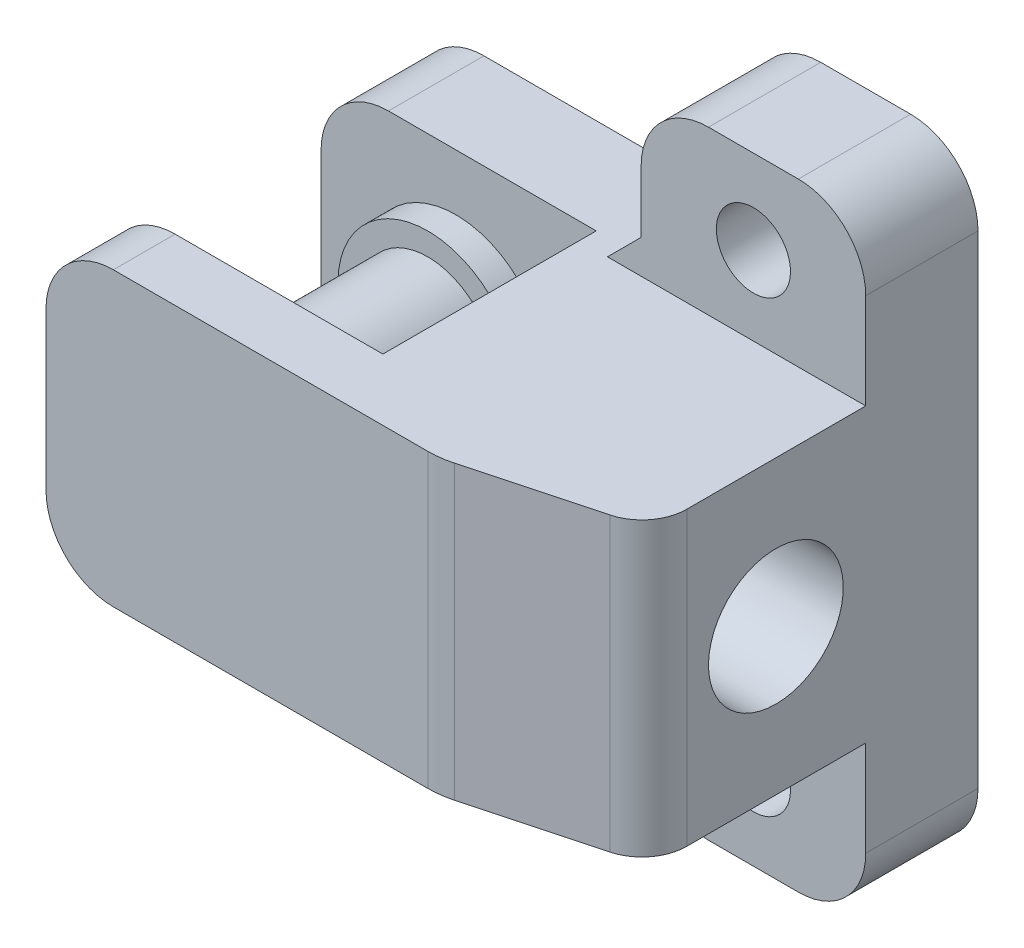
ISO-10303-21;
HEADER;
FILE_DESCRIPTION(('STEP AP214'),'2;1');
FILE_NAME('part.step','',(''),(''),'','','');
FILE_SCHEMA(('AUTOMOTIVE_DESIGN { 1 0 10303 214 1 1 1 1 }'));
ENDSEC;
DATA;
#1=APPLICATION_CONTEXT('core data for automotive mechanical design processes');
#2=APPLICATION_PROTOCOL_DEFINITION('international standard','automotive_design',2000,#1);
#3=PRODUCT_CONTEXT('',#1,'mechanical');
#4=PRODUCT('Part','Part','',(#3));
#5=PRODUCT_RELATED_PRODUCT_CATEGORY('part','',(#4));
#6=PRODUCT_DEFINITION_FORMATION('','',#4);
#7=PRODUCT_DEFINITION_CONTEXT('part definition',#1,'design');
#8=PRODUCT_DEFINITION('design','',#6,#7);
#9=PRODUCT_DEFINITION_SHAPE('','',#8);
#10=(LENGTH_UNIT() NAMED_UNIT(*) SI_UNIT(.MILLI.,.METRE.));
#11=(NAMED_UNIT(*) PLANE_ANGLE_UNIT() SI_UNIT($,.RADIAN.));
#12=(NAMED_UNIT(*) SI_UNIT($,.STERADIAN.) SOLID_ANGLE_UNIT());
#13=UNCERTAINTY_MEASURE_WITH_UNIT(LENGTH_MEASURE(1.E-05),#10,'distance_accuracy_value','');
#14=(GEOMETRIC_REPRESENTATION_CONTEXT(3) GLOBAL_UNCERTAINTY_ASSIGNED_CONTEXT((#13)) GLOBAL_UNIT_ASSIGNED_CONTEXT((#10,
#11,#12)) REPRESENTATION_CONTEXT('',''));
#15=CARTESIAN_POINT('',(0.,0.,0.));
#16=DIRECTION('',(0.,0.,1.));
#17=DIRECTION('',(1.,0.,0.));
#18=AXIS2_PLACEMENT_3D('',#15,#16,#17);
#19=CARTESIAN_POINT('',(-8.1,20.,18.));
#20=DIRECTION('',(-1.,0.,0.));
#21=DIRECTION('',(0.,-1.,0.));
#22=AXIS2_PLACEMENT_3D('',#19,#20,#21);
#23=PLANE('',#22);
#24=CARTESIAN_POINT('',(-8.1,20.,18.));
#25=DIRECTION('',(-1.,0.,0.));
#26=DIRECTION('',(0.,-1.,0.));
#27=AXIS2_PLACEMENT_3D('',#24,#25,#26);
#28=CIRCLE('',#27,6.);
#29=CARTESIAN_POINT('',(-8.1,14.,18.));
#30=VERTEX_POINT('',#29);
#31=EDGE_CURVE('E18',#30,#30,#28,.T.);
#32=ORIENTED_EDGE('',*,*,#31,.F.);
#33=EDGE_LOOP('',(#32));
#34=FACE_BOUND('',#33,.T.);
#35=CARTESIAN_POINT('',(-8.1,20.,18.));
#36=DIRECTION('',(-1.,0.,0.));
#37=DIRECTION('',(0.,-1.,0.));
#38=AXIS2_PLACEMENT_3D('',#35,#36,#37);
#39=CIRCLE('',#38,8.5);
#40=CARTESIAN_POINT('',(-8.1,11.5,18.));
#41=VERTEX_POINT('',#40);
#42=EDGE_CURVE('E338',#41,#41,#39,.F.);
#43=ORIENTED_EDGE('',*,*,#42,.F.);
#44=EDGE_LOOP('',(#43));
#45=FACE_BOUND('',#44,.T.);
#46=ADVANCED_FACE('F14',(#34,#45),#23,.T.);
#47=CARTESIAN_POINT('',(10.,20.,18.));
#48=DIRECTION('',(-1.,0.,0.));
#49=DIRECTION('',(0.,-1.,0.));
#50=AXIS2_PLACEMENT_3D('',#47,#48,#49);
#51=CYLINDRICAL_SURFACE('',#50,6.);
#52=ORIENTED_EDGE('',*,*,#31,.T.);
#53=EDGE_LOOP('',(#52));
#54=FACE_BOUND('',#53,.T.);
#55=CARTESIAN_POINT('',(10.,20.,18.));
#56=DIRECTION('',(-1.,0.,0.));
#57=DIRECTION('',(0.,-1.,0.));
#58=AXIS2_PLACEMENT_3D('',#55,#56,#57);
#59=CIRCLE('',#58,6.);
#60=CARTESIAN_POINT('',(10.,14.,18.));
#61=VERTEX_POINT('',#60);
#62=EDGE_CURVE('E341',#61,#61,#59,.T.);
#63=ORIENTED_EDGE('',*,*,#62,.F.);
#64=EDGE_LOOP('',(#63));
#65=FACE_BOUND('',#64,.T.);
#66=ADVANCED_FACE('F596',(#54,#65),#51,.F.);
#67=CARTESIAN_POINT('',(-10.,36.,10.));
#68=DIRECTION('',(-1.,0.,0.));
#69=DIRECTION('',(0.,-1.,0.));
#70=AXIS2_PLACEMENT_3D('',#67,#68,#69);
#71=PLANE('',#70);
#72=DIRECTION('',(0.,1.,0.));
#73=VECTOR('',#72,1.);
#74=CARTESIAN_POINT('',(-10.,7.,0.));
#75=LINE('',#74,#73);
#76=CARTESIAN_POINT('',(-10.,36.,0.));
#77=VERTEX_POINT('',#76);
#78=CARTESIAN_POINT('',(-10.,41.5,0.));
#79=VERTEX_POINT('',#78);
#80=EDGE_CURVE('E368',#77,#79,#75,.T.);
#81=ORIENTED_EDGE('',*,*,#80,.F.);
#82=DIRECTION('',(0.,0.,1.));
#83=VECTOR('',#82,1.);
#84=CARTESIAN_POINT('',(-10.,36.,10.));
#85=LINE('',#84,#83);
#86=CARTESIAN_POINT('',(-10.,36.,10.));
#87=VERTEX_POINT('',#86);
#88=EDGE_CURVE('E318',#87,#77,#85,.F.);
#89=ORIENTED_EDGE('',*,*,#88,.F.);
#90=DIRECTION('',(0.,1.,0.));
#91=VECTOR('',#90,1.);
#92=CARTESIAN_POINT('',(-10.,47.5,10.));
#93=LINE('',#92,#91);
#94=CARTESIAN_POINT('',(-10.,41.5,10.));
#95=VERTEX_POINT('',#94);
#96=EDGE_CURVE('E460',#95,#87,#93,.F.);
#97=ORIENTED_EDGE('',*,*,#96,.F.);
#98=DIRECTION('',(0.,0.,1.));
#99=VECTOR('',#98,1.);
#100=CARTESIAN_POINT('',(-10.,41.5,5.));
#101=LINE('',#100,#99);
#102=EDGE_CURVE('E386',#79,#95,#101,.T.);
#103=ORIENTED_EDGE('',*,*,#102,.F.);
#104=EDGE_LOOP('',(#81,#89,#97,#103));
#105=FACE_BOUND('',#104,.T.);
#106=ADVANCED_FACE('F594',(#105),#71,.T.);
#107=CARTESIAN_POINT('',(-4.,41.5,0.));
#108=DIRECTION('',(0.,0.,-1.));
#109=DIRECTION('',(-1.,0.,0.));
#110=AXIS2_PLACEMENT_3D('',#107,#108,#109);
#111=CYLINDRICAL_SURFACE('',#110,6.);
#112=CARTESIAN_POINT('',(-4.,41.5,0.));
#113=DIRECTION('',(0.,0.,-1.));
#114=DIRECTION('',(-1.,0.,0.));
#115=AXIS2_PLACEMENT_3D('',#112,#113,#114);
#116=CIRCLE('',#115,6.);
#117=CARTESIAN_POINT('',(-4.,47.5,0.));
#118=VERTEX_POINT('',#117);
#119=EDGE_CURVE('E447',#79,#118,#116,.T.);
#120=ORIENTED_EDGE('',*,*,#119,.F.);
#121=ORIENTED_EDGE('',*,*,#102,.T.);
#122=CARTESIAN_POINT('',(-4.,41.5,10.));
#123=DIRECTION('',(0.,0.,-1.));
#124=DIRECTION('',(-1.,0.,0.));
#125=AXIS2_PLACEMENT_3D('',#122,#123,#124);
#126=CIRCLE('',#125,6.);
#127=CARTESIAN_POINT('',(-4.,47.5,10.));
#128=VERTEX_POINT('',#127);
#129=EDGE_CURVE('E457',#128,#95,#126,.F.);
#130=ORIENTED_EDGE('',*,*,#129,.F.);
#131=DIRECTION('',(0.,0.,1.));
#132=VECTOR('',#131,1.);
#133=CARTESIAN_POINT('',(-4.,47.5,10.));
#134=LINE('',#133,#132);
#135=EDGE_CURVE('E383',#118,#128,#134,.T.);
#136=ORIENTED_EDGE('',*,*,#135,.F.);
#137=EDGE_LOOP('',(#120,#121,#130,#136));
#138=FACE_BOUND('',#137,.T.);
#139=ADVANCED_FACE('F591',(#138),#111,.T.);
#140=CARTESIAN_POINT('',(10.,47.5,10.));
#141=DIRECTION('',(0.,1.,0.));
#142=DIRECTION('',(-1.,0.,0.));
#143=AXIS2_PLACEMENT_3D('',#140,#141,#142);
#144=PLANE('',#143);
#145=DIRECTION('',(1.,0.,0.));
#146=VECTOR('',#145,1.);
#147=CARTESIAN_POINT('',(35.,47.5,0.));
#148=LINE('',#147,#146);
#149=CARTESIAN_POINT('',(4.,47.5,0.));
#150=VERTEX_POINT('',#149);
#151=EDGE_CURVE('E446',#118,#150,#148,.T.);
#152=ORIENTED_EDGE('',*,*,#151,.F.);
#153=ORIENTED_EDGE('',*,*,#135,.T.);
#154=DIRECTION('',(-1.,0.,0.));
#155=VECTOR('',#154,1.);
#156=CARTESIAN_POINT('',(-10.,47.5,10.));
#157=LINE('',#156,#155);
#158=CARTESIAN_POINT('',(4.,47.5,10.));
#159=VERTEX_POINT('',#158);
#160=EDGE_CURVE('E452',#159,#128,#157,.T.);
#161=ORIENTED_EDGE('',*,*,#160,.F.);
#162=DIRECTION('',(0.,0.,1.));
#163=VECTOR('',#162,1.);
#164=CARTESIAN_POINT('',(4.,47.5,5.));
#165=LINE('',#164,#163);
#166=EDGE_CURVE('E379',#150,#159,#165,.T.);
#167=ORIENTED_EDGE('',*,*,#166,.F.);
#168=EDGE_LOOP('',(#152,#153,#161,#167));
#169=FACE_BOUND('',#168,.T.);
#170=ADVANCED_FACE('F588',(#169),#144,.T.);
#171=CARTESIAN_POINT('',(4.,41.5,10.));
#172=DIRECTION('',(0.,0.,1.));
#173=DIRECTION('',(0.,-1.,0.));
#174=AXIS2_PLACEMENT_3D('',#171,#172,#173);
#175=CYLINDRICAL_SURFACE('',#174,6.);
#176=CARTESIAN_POINT('',(4.,41.5,0.));
#177=DIRECTION('',(0.,0.,1.));
#178=DIRECTION('',(0.,-1.,0.));
#179=AXIS2_PLACEMENT_3D('',#176,#177,#178);
#180=CIRCLE('',#179,6.);
#181=CARTESIAN_POINT('',(10.,41.5,0.));
#182=VERTEX_POINT('',#181);
#183=EDGE_CURVE('E443',#150,#182,#180,.F.);
#184=ORIENTED_EDGE('',*,*,#183,.F.);
#185=ORIENTED_EDGE('',*,*,#166,.T.);
#186=CARTESIAN_POINT('',(4.,41.5,10.));
#187=DIRECTION('',(0.,0.,1.));
#188=DIRECTION('',(0.,-1.,0.));
#189=AXIS2_PLACEMENT_3D('',#186,#187,#188);
#190=CIRCLE('',#189,6.);
#191=CARTESIAN_POINT('',(10.,41.5,10.));
#192=VERTEX_POINT('',#191);
#193=EDGE_CURVE('E453',#192,#159,#190,.T.);
#194=ORIENTED_EDGE('',*,*,#193,.F.);
#195=DIRECTION('',(0.,0.,1.));
#196=VECTOR('',#195,1.);
#197=CARTESIAN_POINT('',(10.,41.5,0.));
#198=LINE('',#197,#196);
#199=EDGE_CURVE('E330',#182,#192,#198,.T.);
#200=ORIENTED_EDGE('',*,*,#199,.F.);
#201=EDGE_LOOP('',(#184,#185,#194,#200));
#202=FACE_BOUND('',#201,.T.);
#203=ADVANCED_FACE('F585',(#202),#175,.T.);
#204=CARTESIAN_POINT('',(4.,-1.5,10.));
#205=DIRECTION('',(0.,0.,1.));
#206=DIRECTION('',(0.,-1.,0.));
#207=AXIS2_PLACEMENT_3D('',#204,#205,#206);
#208=CYLINDRICAL_SURFACE('',#207,6.);
#209=CARTESIAN_POINT('',(4.,-1.5,0.));
#210=DIRECTION('',(0.,0.,1.));
#211=DIRECTION('',(0.,-1.,0.));
#212=AXIS2_PLACEMENT_3D('',#209,#210,#211);
#213=CIRCLE('',#212,6.);
#214=CARTESIAN_POINT('',(10.,-1.5,0.));
#215=VERTEX_POINT('',#214);
#216=CARTESIAN_POINT('',(4.,-7.5,0.));
#217=VERTEX_POINT('',#216);
#218=EDGE_CURVE('E439',#215,#217,#213,.F.);
#219=ORIENTED_EDGE('',*,*,#218,.F.);
#220=DIRECTION('',(0.,0.,1.));
#221=VECTOR('',#220,1.);
#222=CARTESIAN_POINT('',(10.,-1.5,0.));
#223=LINE('',#222,#221);
#224=CARTESIAN_POINT('',(10.,-1.5,10.));
#225=VERTEX_POINT('',#224);
#226=EDGE_CURVE('E333',#225,#215,#223,.F.);
#227=ORIENTED_EDGE('',*,*,#226,.F.);
#228=CARTESIAN_POINT('',(4.,-1.5,10.));
#229=DIRECTION('',(0.,0.,1.));
#230=DIRECTION('',(0.,-1.,0.));
#231=AXIS2_PLACEMENT_3D('',#228,#229,#230);
#232=CIRCLE('',#231,6.);
#233=CARTESIAN_POINT('',(4.,-7.5,10.));
#234=VERTEX_POINT('',#233);
#235=EDGE_CURVE('E468',#234,#225,#232,.T.);
#236=ORIENTED_EDGE('',*,*,#235,.F.);
#237=DIRECTION('',(0.,0.,1.));
#238=VECTOR('',#237,1.);
#239=CARTESIAN_POINT('',(4.,-7.5,10.));
#240=LINE('',#239,#238);
#241=EDGE_CURVE('E377',#217,#234,#240,.T.);
#242=ORIENTED_EDGE('',*,*,#241,.F.);
#243=EDGE_LOOP('',(#219,#227,#236,#242));
#244=FACE_BOUND('',#243,.T.);
#245=ADVANCED_FACE('F580',(#244),#208,.T.);
#246=CARTESIAN_POINT('',(10.,-7.5,10.));
#247=DIRECTION('',(0.,-1.,0.));
#248=DIRECTION('',(1.,0.,0.));
#249=AXIS2_PLACEMENT_3D('',#246,#247,#248);
#250=PLANE('',#249);
#251=DIRECTION('',(-1.,0.,0.));
#252=VECTOR('',#251,1.);
#253=CARTESIAN_POINT('',(-10.,-7.5,10.));
#254=LINE('',#253,#252);
#255=CARTESIAN_POINT('',(-4.,-7.5,10.));
#256=VERTEX_POINT('',#255);
#257=EDGE_CURVE('E470',#256,#234,#254,.F.);
#258=ORIENTED_EDGE('',*,*,#257,.F.);
#259=DIRECTION('',(0.,0.,1.));
#260=VECTOR('',#259,1.);
#261=CARTESIAN_POINT('',(-4.,-7.5,5.));
#262=LINE('',#261,#260);
#263=CARTESIAN_POINT('',(-4.,-7.5,0.));
#264=VERTEX_POINT('',#263);
#265=EDGE_CURVE('E375',#264,#256,#262,.T.);
#266=ORIENTED_EDGE('',*,*,#265,.F.);
#267=DIRECTION('',(1.,0.,0.));
#268=VECTOR('',#267,1.);
#269=CARTESIAN_POINT('',(35.,-7.5,0.));
#270=LINE('',#269,#268);
#271=EDGE_CURVE('E438',#217,#264,#270,.F.);
#272=ORIENTED_EDGE('',*,*,#271,.F.);
#273=ORIENTED_EDGE('',*,*,#241,.T.);
#274=EDGE_LOOP('',(#258,#266,#272,#273));
#275=FACE_BOUND('',#274,.T.);
#276=ADVANCED_FACE('F704',(#275),#250,.T.);
#277=CARTESIAN_POINT('',(-4.,-1.5,0.));
#278=DIRECTION('',(0.,0.,-1.));
#279=DIRECTION('',(-1.,0.,0.));
#280=AXIS2_PLACEMENT_3D('',#277,#278,#279);
#281=CYLINDRICAL_SURFACE('',#280,6.);
#282=CARTESIAN_POINT('',(-4.,-1.5,0.));
#283=DIRECTION('',(0.,0.,-1.));
#284=DIRECTION('',(-1.,0.,0.));
#285=AXIS2_PLACEMENT_3D('',#282,#283,#284);
#286=CIRCLE('',#285,6.);
#287=CARTESIAN_POINT('',(-10.,-1.5,0.));
#288=VERTEX_POINT('',#287);
#289=EDGE_CURVE('E435',#264,#288,#286,.T.);
#290=ORIENTED_EDGE('',*,*,#289,.F.);
#291=ORIENTED_EDGE('',*,*,#265,.T.);
#292=CARTESIAN_POINT('',(-4.,-1.5,10.));
#293=DIRECTION('',(0.,0.,-1.));
#294=DIRECTION('',(-1.,0.,0.));
#295=AXIS2_PLACEMENT_3D('',#292,#293,#294);
#296=CIRCLE('',#295,6.);
#297=CARTESIAN_POINT('',(-10.,-1.5,10.));
#298=VERTEX_POINT('',#297);
#299=EDGE_CURVE('E471',#298,#256,#296,.F.);
#300=ORIENTED_EDGE('',*,*,#299,.F.);
#301=DIRECTION('',(0.,0.,1.));
#302=VECTOR('',#301,1.);
#303=CARTESIAN_POINT('',(-10.,-1.5,10.));
#304=LINE('',#303,#302);
#305=EDGE_CURVE('E163',#288,#298,#304,.T.);
#306=ORIENTED_EDGE('',*,*,#305,.F.);
#307=EDGE_LOOP('',(#290,#291,#300,#306));
#308=FACE_BOUND('',#307,.T.);
#309=ADVANCED_FACE('F701',(#308),#281,.T.);
#310=CARTESIAN_POINT('',(-10.,4.,10.));
#311=DIRECTION('',(-1.,0.,0.));
#312=DIRECTION('',(0.,-1.,0.));
#313=AXIS2_PLACEMENT_3D('',#310,#311,#312);
#314=PLANE('',#313);
#315=DIRECTION('',(0.,1.,0.));
#316=VECTOR('',#315,1.);
#317=CARTESIAN_POINT('',(-10.,-7.5,10.));
#318=LINE('',#317,#316);
#319=CARTESIAN_POINT('',(-10.,4.,10.));
#320=VERTEX_POINT('',#319);
#321=EDGE_CURVE('E353',#320,#298,#318,.F.);
#322=ORIENTED_EDGE('',*,*,#321,.F.);
#323=DIRECTION('',(0.,0.,1.));
#324=VECTOR('',#323,1.);
#325=CARTESIAN_POINT('',(-10.,4.,10.));
#326=LINE('',#325,#324);
#327=CARTESIAN_POINT('',(-10.,4.,0.));
#328=VERTEX_POINT('',#327);
#329=EDGE_CURVE('E171',#328,#320,#326,.T.);
#330=ORIENTED_EDGE('',*,*,#329,.F.);
#331=DIRECTION('',(0.,1.,0.));
#332=VECTOR('',#331,1.);
#333=CARTESIAN_POINT('',(-10.,7.,0.));
#334=LINE('',#333,#332);
#335=EDGE_CURVE('E361',#288,#328,#334,.T.);
#336=ORIENTED_EDGE('',*,*,#335,.F.);
#337=ORIENTED_EDGE('',*,*,#305,.T.);
#338=EDGE_LOOP('',(#322,#330,#336,#337));
#339=FACE_BOUND('',#338,.T.);
#340=ADVANCED_FACE('F697',(#339),#314,.T.);
#341=CARTESIAN_POINT('',(0.,0.,10.));
#342=DIRECTION('',(0.,0.,-1.));
#343=DIRECTION('',(0.,1.,0.));
#344=AXIS2_PLACEMENT_3D('',#341,#342,#343);
#345=CYLINDRICAL_SURFACE('',#344,3.3);
#346=CARTESIAN_POINT('',(0.,0.,10.));
#347=DIRECTION('',(0.,0.,-1.));
#348=DIRECTION('',(0.,1.,0.));
#349=AXIS2_PLACEMENT_3D('',#346,#347,#348);
#350=CIRCLE('',#349,3.3);
#351=CARTESIAN_POINT('',(0.,3.3,10.));
#352=VERTEX_POINT('',#351);
#353=EDGE_CURVE('E465',#352,#352,#350,.T.);
#354=ORIENTED_EDGE('',*,*,#353,.F.);
#355=EDGE_LOOP('',(#354));
#356=FACE_BOUND('',#355,.T.);
#357=CARTESIAN_POINT('',(0.,0.,0.));
#358=DIRECTION('',(0.,0.,-1.));
#359=DIRECTION('',(0.,1.,0.));
#360=AXIS2_PLACEMENT_3D('',#357,#358,#359);
#361=CIRCLE('',#360,3.3);
#362=CARTESIAN_POINT('',(0.,3.3,0.));
#363=VERTEX_POINT('',#362);
#364=EDGE_CURVE('E306',#363,#363,#361,.F.);
#365=ORIENTED_EDGE('',*,*,#364,.F.);
#366=EDGE_LOOP('',(#365));
#367=FACE_BOUND('',#366,.T.);
#368=ADVANCED_FACE('F693',(#356,#367),#345,.F.);
#369=CARTESIAN_POINT('',(0.,40.,10.));
#370=DIRECTION('',(0.,0.,-1.));
#371=DIRECTION('',(0.,1.,0.));
#372=AXIS2_PLACEMENT_3D('',#369,#370,#371);
#373=CYLINDRICAL_SURFACE('',#372,3.3);
#374=CARTESIAN_POINT('',(0.,40.,10.));
#375=DIRECTION('',(0.,0.,-1.));
#376=DIRECTION('',(0.,1.,0.));
#377=AXIS2_PLACEMENT_3D('',#374,#375,#376);
#378=CIRCLE('',#377,3.3);
#379=CARTESIAN_POINT('',(0.,43.3,10.));
#380=VERTEX_POINT('',#379);
#381=EDGE_CURVE('E319',#380,#380,#378,.T.);
#382=ORIENTED_EDGE('',*,*,#381,.F.);
#383=EDGE_LOOP('',(#382));
#384=FACE_BOUND('',#383,.T.);
#385=CARTESIAN_POINT('',(0.,40.,0.));
#386=DIRECTION('',(0.,0.,-1.));
#387=DIRECTION('',(0.,1.,0.));
#388=AXIS2_PLACEMENT_3D('',#385,#386,#387);
#389=CIRCLE('',#388,3.3);
#390=CARTESIAN_POINT('',(0.,43.3,0.));
#391=VERTEX_POINT('',#390);
#392=EDGE_CURVE('E365',#391,#391,#389,.F.);
#393=ORIENTED_EDGE('',*,*,#392,.F.);
#394=EDGE_LOOP('',(#393));
#395=FACE_BOUND('',#394,.T.);
#396=ADVANCED_FACE('F690',(#384,#395),#373,.F.);
#397=CARTESIAN_POINT('',(-10.,4.,10.));
#398=DIRECTION('',(-0.707106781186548,-0.707106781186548,0.));
#399=DIRECTION('',(0.707106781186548,-0.707106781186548,0.));
#400=AXIS2_PLACEMENT_3D('',#397,#398,#399);
#401=PLANE('',#400);
#402=DIRECTION('',(0.707106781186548,-0.707106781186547,0.));
#403=VECTOR('',#402,1.);
#404=CARTESIAN_POINT('',(-13.,7.,10.));
#405=LINE('',#404,#403);
#406=CARTESIAN_POINT('',(-13.,7.,10.));
#407=VERTEX_POINT('',#406);
#408=EDGE_CURVE('E350',#407,#320,#405,.T.);
#409=ORIENTED_EDGE('',*,*,#408,.F.);
#410=DIRECTION('',(0.,0.,1.));
#411=VECTOR('',#410,1.);
#412=CARTESIAN_POINT('',(-13.,7.,33.));
#413=LINE('',#412,#411);
#414=CARTESIAN_POINT('',(-13.,7.,0.));
#415=VERTEX_POINT('',#414);
#416=EDGE_CURVE('E294',#415,#407,#413,.T.);
#417=ORIENTED_EDGE('',*,*,#416,.F.);
#418=DIRECTION('',(-0.707106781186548,0.707106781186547,0.));
#419=VECTOR('',#418,1.);
#420=CARTESIAN_POINT('',(-10.,4.,0.));
#421=LINE('',#420,#419);
#422=EDGE_CURVE('E307',#328,#415,#421,.T.);
#423=ORIENTED_EDGE('',*,*,#422,.F.);
#424=ORIENTED_EDGE('',*,*,#329,.T.);
#425=EDGE_LOOP('',(#409,#417,#423,#424));
#426=FACE_BOUND('',#425,.T.);
#427=ADVANCED_FACE('F575',(#426),#401,.T.);
#428=CARTESIAN_POINT('',(-10.,-7.5,10.));
#429=DIRECTION('',(0.,0.,-1.));
#430=DIRECTION('',(-1.,0.,0.));
#431=AXIS2_PLACEMENT_3D('',#428,#429,#430);
#432=PLANE('',#431);
#433=ORIENTED_EDGE('',*,*,#353,.T.);
#434=EDGE_LOOP('',(#433));
#435=FACE_BOUND('',#434,.T.);
#436=ORIENTED_EDGE('',*,*,#235,.T.);
#437=DIRECTION('',(0.,-1.,0.));
#438=VECTOR('',#437,1.);
#439=CARTESIAN_POINT('',(10.,7.,10.));
#440=LINE('',#439,#438);
#441=CARTESIAN_POINT('',(10.,7.,10.));
#442=VERTEX_POINT('',#441);
#443=EDGE_CURVE('E329',#442,#225,#440,.T.);
#444=ORIENTED_EDGE('',*,*,#443,.F.);
#445=DIRECTION('',(-1.,0.,0.));
#446=VECTOR('',#445,1.);
#447=CARTESIAN_POINT('',(35.,7.,10.));
#448=LINE('',#447,#446);
#449=EDGE_CURVE('E344',#407,#442,#448,.F.);
#450=ORIENTED_EDGE('',*,*,#449,.F.);
#451=ORIENTED_EDGE('',*,*,#408,.T.);
#452=ORIENTED_EDGE('',*,*,#321,.T.);
#453=ORIENTED_EDGE('',*,*,#299,.T.);
#454=ORIENTED_EDGE('',*,*,#257,.T.);
#455=EDGE_LOOP('',(#436,#444,#450,#451,#452,#453,#454));
#456=FACE_BOUND('',#455,.T.);
#457=ADVANCED_FACE('F576',(#435,#456),#432,.F.);
#458=CARTESIAN_POINT('',(-8.1,20.,18.));
#459=DIRECTION('',(-1.,0.,0.));
#460=DIRECTION('',(0.,-1.,0.));
#461=AXIS2_PLACEMENT_3D('',#458,#459,#460);
#462=CYLINDRICAL_SURFACE('',#461,8.5);
#463=ORIENTED_EDGE('',*,*,#42,.T.);
#464=EDGE_LOOP('',(#463));
#465=FACE_BOUND('',#464,.T.);
#466=CARTESIAN_POINT('',(-15.5,20.,18.));
#467=DIRECTION('',(-1.,0.,0.));
#468=DIRECTION('',(0.,-1.,0.));
#469=AXIS2_PLACEMENT_3D('',#466,#467,#468);
#470=CIRCLE('',#469,8.5);
#471=CARTESIAN_POINT('',(-15.5,11.5,18.));
#472=VERTEX_POINT('',#471);
#473=EDGE_CURVE('E271',#472,#472,#470,.F.);
#474=ORIENTED_EDGE('',*,*,#473,.F.);
#475=EDGE_LOOP('',(#474));
#476=FACE_BOUND('',#475,.T.);
#477=ADVANCED_FACE('F681',(#465,#476),#462,.F.);
#478=CARTESIAN_POINT('',(-28.,20.,33.));
#479=DIRECTION('',(0.,0.,-1.));
#480=DIRECTION('',(-1.,0.,0.));
#481=AXIS2_PLACEMENT_3D('',#478,#479,#480);
#482=PLANE('',#481);
#483=DIRECTION('',(-1.,0.,0.));
#484=VECTOR('',#483,1.);
#485=CARTESIAN_POINT('',(35.,7.,33.));
#486=LINE('',#485,#484);
#487=CARTESIAN_POINT('',(-5.981423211,7.,33.));
#488=VERTEX_POINT('',#487);
#489=CARTESIAN_POINT('',(-34.,7.,33.));
#490=VERTEX_POINT('',#489);
#491=EDGE_CURVE('E280',#488,#490,#486,.T.);
#492=ORIENTED_EDGE('',*,*,#491,.F.);
#493=DIRECTION('',(0.,-1.,0.));
#494=VECTOR('',#493,1.);
#495=CARTESIAN_POINT('',(-5.981423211,20.,33.));
#496=LINE('',#495,#494);
#497=CARTESIAN_POINT('',(-5.981423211,33.,33.));
#498=VERTEX_POINT('',#497);
#499=EDGE_CURVE('E336',#498,#488,#496,.T.);
#500=ORIENTED_EDGE('',*,*,#499,.F.);
#501=DIRECTION('',(1.,0.,0.));
#502=VECTOR('',#501,1.);
#503=CARTESIAN_POINT('',(35.,33.,33.));
#504=LINE('',#503,#502);
#505=CARTESIAN_POINT('',(-34.,33.,33.));
#506=VERTEX_POINT('',#505);
#507=EDGE_CURVE('E286',#506,#498,#504,.T.);
#508=ORIENTED_EDGE('',*,*,#507,.F.);
#509=CARTESIAN_POINT('',(-34.,27.,33.));
#510=DIRECTION('',(0.,0.,-1.));
#511=DIRECTION('',(-1.,0.,0.));
#512=AXIS2_PLACEMENT_3D('',#509,#510,#511);
#513=CIRCLE('',#512,6.);
#514=CARTESIAN_POINT('',(-40.,27.,33.));
#515=VERTEX_POINT('',#514);
#516=EDGE_CURVE('E290',#515,#506,#513,.T.);
#517=ORIENTED_EDGE('',*,*,#516,.F.);
#518=DIRECTION('',(0.,-1.,0.));
#519=VECTOR('',#518,1.);
#520=CARTESIAN_POINT('',(-40.,33.,33.));
#521=LINE('',#520,#519);
#522=CARTESIAN_POINT('',(-40.,13.,33.));
#523=VERTEX_POINT('',#522);
#524=EDGE_CURVE('E291',#523,#515,#521,.F.);
#525=ORIENTED_EDGE('',*,*,#524,.F.);
#526=CARTESIAN_POINT('',(-34.,13.,33.));
#527=DIRECTION('',(0.,0.,1.));
#528=DIRECTION('',(1.,0.,0.));
#529=AXIS2_PLACEMENT_3D('',#526,#527,#528);
#530=CIRCLE('',#529,6.);
#531=EDGE_CURVE('E279',#490,#523,#530,.F.);
#532=ORIENTED_EDGE('',*,*,#531,.F.);
#533=EDGE_LOOP('',(#492,#500,#508,#517,#525,#532));
#534=FACE_BOUND('',#533,.T.);
#535=ADVANCED_FACE('F535',(#534),#482,.F.);
#536=CARTESIAN_POINT('',(-5.981423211,33.,25.));
#537=DIRECTION('',(0.,1.,0.));
#538=DIRECTION('',(0.,0.,1.));
#539=AXIS2_PLACEMENT_3D('',#536,#537,#538);
#540=CYLINDRICAL_SURFACE('',#539,8.);
#541=CARTESIAN_POINT('',(-5.981423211,33.,25.));
#542=DIRECTION('',(0.,1.,0.));
#543=DIRECTION('',(0.,0.,1.));
#544=AXIS2_PLACEMENT_3D('',#541,#542,#543);
#545=CIRCLE('',#544,8.);
#546=CARTESIAN_POINT('',(-3.91087085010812,33.,32.7274066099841));
#547=VERTEX_POINT('',#546);
#548=EDGE_CURVE('E416',#498,#547,#545,.T.);
#549=ORIENTED_EDGE('',*,*,#548,.F.);
#550=ORIENTED_EDGE('',*,*,#499,.T.);
#551=CARTESIAN_POINT('',(-5.981423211,7.,25.));
#552=DIRECTION('',(0.,1.,0.));
#553=DIRECTION('',(0.,0.,1.));
#554=AXIS2_PLACEMENT_3D('',#551,#552,#553);
#555=CIRCLE('',#554,8.);
#556=CARTESIAN_POINT('',(-3.91087085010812,7.,32.7274066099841));
#557=VERTEX_POINT('',#556);
#558=EDGE_CURVE('E421',#557,#488,#555,.F.);
#559=ORIENTED_EDGE('',*,*,#558,.F.);
#560=DIRECTION('',(0.,1.,0.));
#561=VECTOR('',#560,1.);
#562=CARTESIAN_POINT('',(-3.91087085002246,5.,32.7274066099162));
#563=LINE('',#562,#561);
#564=EDGE_CURVE('E334',#547,#557,#563,.F.);
#565=ORIENTED_EDGE('',*,*,#564,.F.);
#566=EDGE_LOOP('',(#549,#550,#559,#565));
#567=FACE_BOUND('',#566,.T.);
#568=ADVANCED_FACE('F538',(#567),#540,.T.);
#569=CARTESIAN_POINT('',(10.,5.,29.));
#570=DIRECTION('',(-0.258819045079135,0.,-0.965925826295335));
#571=DIRECTION('',(-0.965925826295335,0.,0.258819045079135));
#572=AXIS2_PLACEMENT_3D('',#569,#570,#571);
#573=PLANE('',#572);
#574=DIRECTION('',(0.965925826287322,0.,-0.258819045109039));
#575=VECTOR('',#574,1.);
#576=CARTESIAN_POINT('',(-3.91087085,33.,32.72740661));
#577=LINE('',#576,#575);
#578=CARTESIAN_POINT('',(7.03527618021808,33.,29.7943953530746));
#579=VERTEX_POINT('',#578);
#580=EDGE_CURVE('E415',#547,#579,#577,.T.);
#581=ORIENTED_EDGE('',*,*,#580,.F.);
#582=ORIENTED_EDGE('',*,*,#564,.T.);
#583=DIRECTION('',(-0.965925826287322,0.,0.258819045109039));
#584=VECTOR('',#583,1.);
#585=CARTESIAN_POINT('',(7.03527618,7.,29.794395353));
#586=LINE('',#585,#584);
#587=CARTESIAN_POINT('',(7.03527618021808,7.,29.7943953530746));
#588=VERTEX_POINT('',#587);
#589=EDGE_CURVE('E424',#588,#557,#586,.T.);
#590=ORIENTED_EDGE('',*,*,#589,.F.);
#591=DIRECTION('',(0.,-1.,0.));
#592=VECTOR('',#591,1.);
#593=CARTESIAN_POINT('',(7.03527618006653,20.,29.7943953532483));
#594=LINE('',#593,#592);
#595=EDGE_CURVE('E331',#579,#588,#594,.T.);
#596=ORIENTED_EDGE('',*,*,#595,.F.);
#597=EDGE_LOOP('',(#581,#582,#590,#596));
#598=FACE_BOUND('',#597,.T.);
#599=ADVANCED_FACE('F542',(#598),#573,.F.);
#600=CARTESIAN_POINT('',(6.,7.,25.930692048));
#601=DIRECTION('',(0.,-1.,0.));
#602=DIRECTION('',(0.,0.,-1.));
#603=AXIS2_PLACEMENT_3D('',#600,#601,#602);
#604=CYLINDRICAL_SURFACE('',#603,4.);
#605=CARTESIAN_POINT('',(6.,7.,25.930692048));
#606=DIRECTION('',(0.,-1.,0.));
#607=DIRECTION('',(0.,0.,-1.));
#608=AXIS2_PLACEMENT_3D('',#605,#606,#607);
#609=CIRCLE('',#608,4.);
#610=CARTESIAN_POINT('',(10.,7.,25.930692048));
#611=VERTEX_POINT('',#610);
#612=EDGE_CURVE('E425',#611,#588,#609,.T.);
#613=ORIENTED_EDGE('',*,*,#612,.F.);
#614=DIRECTION('',(0.,-1.,0.));
#615=VECTOR('',#614,1.);
#616=CARTESIAN_POINT('',(10.,7.,25.930692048));
#617=LINE('',#616,#615);
#618=CARTESIAN_POINT('',(10.,33.,25.930692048));
#619=VERTEX_POINT('',#618);
#620=EDGE_CURVE('E327',#619,#611,#617,.T.);
#621=ORIENTED_EDGE('',*,*,#620,.F.);
#622=CARTESIAN_POINT('',(6.,33.,25.930692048));
#623=DIRECTION('',(0.,-1.,0.));
#624=DIRECTION('',(0.,0.,-1.));
#625=AXIS2_PLACEMENT_3D('',#622,#623,#624);
#626=CIRCLE('',#625,4.);
#627=EDGE_CURVE('E412',#579,#619,#626,.F.);
#628=ORIENTED_EDGE('',*,*,#627,.F.);
#629=ORIENTED_EDGE('',*,*,#595,.T.);
#630=EDGE_LOOP('',(#613,#621,#628,#629));
#631=FACE_BOUND('',#630,.T.);
#632=ADVANCED_FACE('F547',(#631),#604,.T.);
#633=CARTESIAN_POINT('',(10.,7.,0.));
#634=DIRECTION('',(-1.,0.,0.));
#635=DIRECTION('',(0.,-1.,0.));
#636=AXIS2_PLACEMENT_3D('',#633,#634,#635);
#637=PLANE('',#636);
#638=ORIENTED_EDGE('',*,*,#62,.T.);
#639=EDGE_LOOP('',(#638));
#640=FACE_BOUND('',#639,.T.);
#641=DIRECTION('',(0.,0.,1.));
#642=VECTOR('',#641,1.);
#643=CARTESIAN_POINT('',(10.,7.,33.));
#644=LINE('',#643,#642);
#645=EDGE_CURVE('E347',#442,#611,#644,.T.);
#646=ORIENTED_EDGE('',*,*,#645,.F.);
#647=ORIENTED_EDGE('',*,*,#443,.T.);
#648=ORIENTED_EDGE('',*,*,#226,.T.);
#649=DIRECTION('',(0.,1.,0.));
#650=VECTOR('',#649,1.);
#651=CARTESIAN_POINT('',(10.,7.,0.));
#652=LINE('',#651,#650);
#653=EDGE_CURVE('E442',#182,#215,#652,.F.);
#654=ORIENTED_EDGE('',*,*,#653,.F.);
#655=ORIENTED_EDGE('',*,*,#199,.T.);
#656=DIRECTION('',(0.,1.,0.));
#657=VECTOR('',#656,1.);
#658=CARTESIAN_POINT('',(10.,47.5,10.));
#659=LINE('',#658,#657);
#660=CARTESIAN_POINT('',(10.,33.,10.));
#661=VERTEX_POINT('',#660);
#662=EDGE_CURVE('E456',#661,#192,#659,.T.);
#663=ORIENTED_EDGE('',*,*,#662,.F.);
#664=DIRECTION('',(0.,0.,1.));
#665=VECTOR('',#664,1.);
#666=CARTESIAN_POINT('',(10.,33.,33.));
#667=LINE('',#666,#665);
#668=EDGE_CURVE('E324',#619,#661,#667,.F.);
#669=ORIENTED_EDGE('',*,*,#668,.F.);
#670=ORIENTED_EDGE('',*,*,#620,.T.);
#671=EDGE_LOOP('',(#646,#647,#648,#654,#655,#663,#669,#670));
#672=FACE_BOUND('',#671,.T.);
#673=ADVANCED_FACE('F550',(#640,#672),#637,.F.);
#674=CARTESIAN_POINT('',(-10.,47.5,10.));
#675=DIRECTION('',(0.,0.,-1.));
#676=DIRECTION('',(-1.,0.,0.));
#677=AXIS2_PLACEMENT_3D('',#674,#675,#676);
#678=PLANE('',#677);
#679=ORIENTED_EDGE('',*,*,#381,.T.);
#680=EDGE_LOOP('',(#679));
#681=FACE_BOUND('',#680,.T.);
#682=ORIENTED_EDGE('',*,*,#193,.T.);
#683=ORIENTED_EDGE('',*,*,#160,.T.);
#684=ORIENTED_EDGE('',*,*,#129,.T.);
#685=ORIENTED_EDGE('',*,*,#96,.T.);
#686=DIRECTION('',(-0.707106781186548,-0.707106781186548,0.));
#687=VECTOR('',#686,1.);
#688=CARTESIAN_POINT('',(-10.,36.,10.));
#689=LINE('',#688,#687);
#690=CARTESIAN_POINT('',(-13.,33.,10.));
#691=VERTEX_POINT('',#690);
#692=EDGE_CURVE('E315',#691,#87,#689,.F.);
#693=ORIENTED_EDGE('',*,*,#692,.F.);
#694=DIRECTION('',(1.,0.,0.));
#695=VECTOR('',#694,1.);
#696=CARTESIAN_POINT('',(35.,33.,10.));
#697=LINE('',#696,#695);
#698=EDGE_CURVE('E312',#661,#691,#697,.F.);
#699=ORIENTED_EDGE('',*,*,#698,.F.);
#700=ORIENTED_EDGE('',*,*,#662,.T.);
#701=EDGE_LOOP('',(#682,#683,#684,#685,#693,#699,#700));
#702=FACE_BOUND('',#701,.T.);
#703=ADVANCED_FACE('F555',(#681,#702),#678,.F.);
#704=CARTESIAN_POINT('',(-10.,36.,10.));
#705=DIRECTION('',(-0.707106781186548,0.707106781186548,0.));
#706=DIRECTION('',(-0.707106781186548,-0.707106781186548,0.));
#707=AXIS2_PLACEMENT_3D('',#704,#705,#706);
#708=PLANE('',#707);
#709=ORIENTED_EDGE('',*,*,#692,.T.);
#710=ORIENTED_EDGE('',*,*,#88,.T.);
#711=DIRECTION('',(0.707106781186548,0.707106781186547,0.));
#712=VECTOR('',#711,1.);
#713=CARTESIAN_POINT('',(-13.,33.,0.));
#714=LINE('',#713,#712);
#715=CARTESIAN_POINT('',(-13.,33.,0.));
#716=VERTEX_POINT('',#715);
#717=EDGE_CURVE('E303',#716,#77,#714,.T.);
#718=ORIENTED_EDGE('',*,*,#717,.F.);
#719=DIRECTION('',(0.,0.,1.));
#720=VECTOR('',#719,1.);
#721=CARTESIAN_POINT('',(-13.,33.,33.));
#722=LINE('',#721,#720);
#723=EDGE_CURVE('E300',#691,#716,#722,.F.);
#724=ORIENTED_EDGE('',*,*,#723,.F.);
#725=EDGE_LOOP('',(#709,#710,#718,#724));
#726=FACE_BOUND('',#725,.T.);
#727=ADVANCED_FACE('F559',(#726),#708,.T.);
#728=CARTESIAN_POINT('',(35.,7.,0.));
#729=DIRECTION('',(0.,0.,1.));
#730=DIRECTION('',(1.,0.,0.));
#731=AXIS2_PLACEMENT_3D('',#728,#729,#730);
#732=PLANE('',#731);
#733=ORIENTED_EDGE('',*,*,#392,.T.);
#734=EDGE_LOOP('',(#733));
#735=FACE_BOUND('',#734,.T.);
#736=ORIENTED_EDGE('',*,*,#364,.T.);
#737=EDGE_LOOP('',(#736));
#738=FACE_BOUND('',#737,.T.);
#739=DIRECTION('',(1.,0.,0.));
#740=VECTOR('',#739,1.);
#741=CARTESIAN_POINT('',(35.,33.,0.));
#742=LINE('',#741,#740);
#743=CARTESIAN_POINT('',(-34.,33.,0.));
#744=VERTEX_POINT('',#743);
#745=EDGE_CURVE('E213',#716,#744,#742,.F.);
#746=ORIENTED_EDGE('',*,*,#745,.F.);
#747=ORIENTED_EDGE('',*,*,#717,.T.);
#748=ORIENTED_EDGE('',*,*,#80,.T.);
#749=ORIENTED_EDGE('',*,*,#119,.T.);
#750=ORIENTED_EDGE('',*,*,#151,.T.);
#751=ORIENTED_EDGE('',*,*,#183,.T.);
#752=ORIENTED_EDGE('',*,*,#653,.T.);
#753=ORIENTED_EDGE('',*,*,#218,.T.);
#754=ORIENTED_EDGE('',*,*,#271,.T.);
#755=ORIENTED_EDGE('',*,*,#289,.T.);
#756=ORIENTED_EDGE('',*,*,#335,.T.);
#757=ORIENTED_EDGE('',*,*,#422,.T.);
#758=DIRECTION('',(-1.,0.,0.));
#759=VECTOR('',#758,1.);
#760=CARTESIAN_POINT('',(35.,7.,0.));
#761=LINE('',#760,#759);
#762=CARTESIAN_POINT('',(-34.,7.,0.));
#763=VERTEX_POINT('',#762);
#764=EDGE_CURVE('E278',#763,#415,#761,.F.);
#765=ORIENTED_EDGE('',*,*,#764,.F.);
#766=CARTESIAN_POINT('',(-34.,13.,0.));
#767=DIRECTION('',(0.,0.,1.));
#768=DIRECTION('',(1.,0.,0.));
#769=AXIS2_PLACEMENT_3D('',#766,#767,#768);
#770=CIRCLE('',#769,6.);
#771=CARTESIAN_POINT('',(-40.,13.,0.));
#772=VERTEX_POINT('',#771);
#773=EDGE_CURVE('E256',#772,#763,#770,.T.);
#774=ORIENTED_EDGE('',*,*,#773,.F.);
#775=DIRECTION('',(0.,-1.,0.));
#776=VECTOR('',#775,1.);
#777=CARTESIAN_POINT('',(-40.,33.,0.));
#778=LINE('',#777,#776);
#779=CARTESIAN_POINT('',(-40.,27.,0.));
#780=VERTEX_POINT('',#779);
#781=EDGE_CURVE('E261',#780,#772,#778,.T.);
#782=ORIENTED_EDGE('',*,*,#781,.F.);
#783=CARTESIAN_POINT('',(-34.,27.,0.));
#784=DIRECTION('',(0.,0.,-1.));
#785=DIRECTION('',(-1.,0.,0.));
#786=AXIS2_PLACEMENT_3D('',#783,#784,#785);
#787=CIRCLE('',#786,6.);
#788=EDGE_CURVE('E212',#744,#780,#787,.F.);
#789=ORIENTED_EDGE('',*,*,#788,.F.);
#790=EDGE_LOOP('',(#746,#747,#748,#749,#750,#751,#752,#753,#754,#755,#756,#757,#765,#774,#782,#789));
#791=FACE_BOUND('',#790,.T.);
#792=ADVANCED_FACE('F562',(#735,#738,#791),#732,.F.);
#793=CARTESIAN_POINT('',(-40.,33.,0.));
#794=DIRECTION('',(-1.,0.,0.));
#795=DIRECTION('',(0.,-1.,0.));
#796=AXIS2_PLACEMENT_3D('',#793,#794,#795);
#797=PLANE('',#796);
#798=ORIENTED_EDGE('',*,*,#524,.T.);
#799=DIRECTION('',(0.,0.,1.));
#800=VECTOR('',#799,1.);
#801=CARTESIAN_POINT('',(-40.,27.,30.25));
#802=LINE('',#801,#800);
#803=CARTESIAN_POINT('',(-40.,27.,27.5));
#804=VERTEX_POINT('',#803);
#805=EDGE_CURVE('E287',#804,#515,#802,.T.);
#806=ORIENTED_EDGE('',*,*,#805,.F.);
#807=DIRECTION('',(0.,1.,0.));
#808=VECTOR('',#807,1.);
#809=CARTESIAN_POINT('',(-40.,33.,27.5));
#810=LINE('',#809,#808);
#811=CARTESIAN_POINT('',(-40.,13.,27.5));
#812=VERTEX_POINT('',#811);
#813=EDGE_CURVE('E229',#812,#804,#810,.T.);
#814=ORIENTED_EDGE('',*,*,#813,.F.);
#815=DIRECTION('',(0.,0.,-1.));
#816=VECTOR('',#815,1.);
#817=CARTESIAN_POINT('',(-40.,13.,30.25));
#818=LINE('',#817,#816);
#819=EDGE_CURVE('E275',#523,#812,#818,.T.);
#820=ORIENTED_EDGE('',*,*,#819,.F.);
#821=EDGE_LOOP('',(#798,#806,#814,#820));
#822=FACE_BOUND('',#821,.T.);
#823=ADVANCED_FACE('F528',(#822),#797,.T.);
#824=CARTESIAN_POINT('',(-34.,27.,27.5));
#825=DIRECTION('',(0.,0.,-1.));
#826=DIRECTION('',(-1.,0.,0.));
#827=AXIS2_PLACEMENT_3D('',#824,#825,#826);
#828=CYLINDRICAL_SURFACE('',#827,6.);
#829=ORIENTED_EDGE('',*,*,#516,.T.);
#830=DIRECTION('',(0.,0.,1.));
#831=VECTOR('',#830,1.);
#832=CARTESIAN_POINT('',(-34.,33.,33.));
#833=LINE('',#832,#831);
#834=CARTESIAN_POINT('',(-34.,33.,27.5));
#835=VERTEX_POINT('',#834);
#836=EDGE_CURVE('E284',#835,#506,#833,.T.);
#837=ORIENTED_EDGE('',*,*,#836,.F.);
#838=CARTESIAN_POINT('',(-34.,27.,27.5));
#839=DIRECTION('',(0.,0.,-1.));
#840=DIRECTION('',(-1.,0.,0.));
#841=AXIS2_PLACEMENT_3D('',#838,#839,#840);
#842=CIRCLE('',#841,6.);
#843=EDGE_CURVE('E227',#804,#835,#842,.T.);
#844=ORIENTED_EDGE('',*,*,#843,.F.);
#845=ORIENTED_EDGE('',*,*,#805,.T.);
#846=EDGE_LOOP('',(#829,#837,#844,#845));
#847=FACE_BOUND('',#846,.T.);
#848=ADVANCED_FACE('F531',(#847),#828,.T.);
#849=CARTESIAN_POINT('',(-34.,13.,33.));
#850=DIRECTION('',(0.,0.,1.));
#851=DIRECTION('',(1.,0.,0.));
#852=AXIS2_PLACEMENT_3D('',#849,#850,#851);
#853=CYLINDRICAL_SURFACE('',#852,6.);
#854=CARTESIAN_POINT('',(-34.,13.,27.5));
#855=DIRECTION('',(0.,0.,1.));
#856=DIRECTION('',(1.,0.,0.));
#857=AXIS2_PLACEMENT_3D('',#854,#855,#856);
#858=CIRCLE('',#857,6.);
#859=CARTESIAN_POINT('',(-34.,7.,27.5));
#860=VERTEX_POINT('',#859);
#861=EDGE_CURVE('E251',#860,#812,#858,.F.);
#862=ORIENTED_EDGE('',*,*,#861,.F.);
#863=DIRECTION('',(0.,0.,1.));
#864=VECTOR('',#863,1.);
#865=CARTESIAN_POINT('',(-34.,7.,33.));
#866=LINE('',#865,#864);
#867=EDGE_CURVE('E272',#490,#860,#866,.F.);
#868=ORIENTED_EDGE('',*,*,#867,.F.);
#869=ORIENTED_EDGE('',*,*,#531,.T.);
#870=ORIENTED_EDGE('',*,*,#819,.T.);
#871=EDGE_LOOP('',(#862,#868,#869,#870));
#872=FACE_BOUND('',#871,.T.);
#873=ADVANCED_FACE('F525',(#872),#853,.T.);
#874=CARTESIAN_POINT('',(35.,7.,33.));
#875=DIRECTION('',(0.,1.,0.));
#876=DIRECTION('',(-1.,0.,0.));
#877=AXIS2_PLACEMENT_3D('',#874,#875,#876);
#878=PLANE('',#877);
#879=DIRECTION('',(0.,0.,1.));
#880=VECTOR('',#879,1.);
#881=CARTESIAN_POINT('',(-15.5,7.,27.5));
#882=LINE('',#881,#880);
#883=CARTESIAN_POINT('',(-15.5,7.,8.5));
#884=VERTEX_POINT('',#883);
#885=CARTESIAN_POINT('',(-15.5,7.,27.5));
#886=VERTEX_POINT('',#885);
#887=EDGE_CURVE('E218',#884,#886,#882,.T.);
#888=ORIENTED_EDGE('',*,*,#887,.F.);
#889=DIRECTION('',(-1.,0.,0.));
#890=VECTOR('',#889,1.);
#891=CARTESIAN_POINT('',(-40.,7.,8.5));
#892=LINE('',#891,#890);
#893=CARTESIAN_POINT('',(-34.,7.,8.5));
#894=VERTEX_POINT('',#893);
#895=EDGE_CURVE('E248',#894,#884,#892,.F.);
#896=ORIENTED_EDGE('',*,*,#895,.F.);
#897=DIRECTION('',(0.,0.,1.));
#898=VECTOR('',#897,1.);
#899=CARTESIAN_POINT('',(-34.,7.,4.25));
#900=LINE('',#899,#898);
#901=EDGE_CURVE('E238',#763,#894,#900,.T.);
#902=ORIENTED_EDGE('',*,*,#901,.F.);
#903=ORIENTED_EDGE('',*,*,#764,.T.);
#904=ORIENTED_EDGE('',*,*,#416,.T.);
#905=ORIENTED_EDGE('',*,*,#449,.T.);
#906=ORIENTED_EDGE('',*,*,#645,.T.);
#907=ORIENTED_EDGE('',*,*,#612,.T.);
#908=ORIENTED_EDGE('',*,*,#589,.T.);
#909=ORIENTED_EDGE('',*,*,#558,.T.);
#910=ORIENTED_EDGE('',*,*,#491,.T.);
#911=ORIENTED_EDGE('',*,*,#867,.T.);
#912=DIRECTION('',(1.,0.,0.));
#913=VECTOR('',#912,1.);
#914=CARTESIAN_POINT('',(-40.,7.,27.5));
#915=LINE('',#914,#913);
#916=EDGE_CURVE('E222',#886,#860,#915,.F.);
#917=ORIENTED_EDGE('',*,*,#916,.F.);
#918=EDGE_LOOP('',(#888,#896,#902,#903,#904,#905,#906,#907,#908,#909,#910,#911,#917));
#919=FACE_BOUND('',#918,.T.);
#920=ADVANCED_FACE('F521',(#919),#878,.F.);
#921=CARTESIAN_POINT('',(-15.5,33.,27.5));
#922=DIRECTION('',(1.,0.,0.));
#923=DIRECTION('',(0.,1.,0.));
#924=AXIS2_PLACEMENT_3D('',#921,#922,#923);
#925=PLANE('',#924);
#926=ORIENTED_EDGE('',*,*,#473,.T.);
#927=EDGE_LOOP('',(#926));
#928=FACE_BOUND('',#927,.T.);
#929=DIRECTION('',(0.,0.,1.));
#930=VECTOR('',#929,1.);
#931=CARTESIAN_POINT('',(-15.5,33.,33.));
#932=LINE('',#931,#930);
#933=CARTESIAN_POINT('',(-15.5,33.,8.5));
#934=VERTEX_POINT('',#933);
#935=CARTESIAN_POINT('',(-15.5,33.,27.5));
#936=VERTEX_POINT('',#935);
#937=EDGE_CURVE('E200',#934,#936,#932,.T.);
#938=ORIENTED_EDGE('',*,*,#937,.F.);
#939=DIRECTION('',(0.,1.,0.));
#940=VECTOR('',#939,1.);
#941=CARTESIAN_POINT('',(-15.5,33.,8.5));
#942=LINE('',#941,#940);
#943=EDGE_CURVE('E245',#884,#934,#942,.T.);
#944=ORIENTED_EDGE('',*,*,#943,.F.);
#945=ORIENTED_EDGE('',*,*,#887,.T.);
#946=DIRECTION('',(0.,1.,0.));
#947=VECTOR('',#946,1.);
#948=CARTESIAN_POINT('',(-15.5,33.,27.5));
#949=LINE('',#948,#947);
#950=EDGE_CURVE('E216',#936,#886,#949,.F.);
#951=ORIENTED_EDGE('',*,*,#950,.F.);
#952=EDGE_LOOP('',(#938,#944,#945,#951));
#953=FACE_BOUND('',#952,.T.);
#954=ADVANCED_FACE('F217',(#928,#953),#925,.F.);
#955=CARTESIAN_POINT('',(35.,33.,33.));
#956=DIRECTION('',(0.,-1.,0.));
#957=DIRECTION('',(1.,0.,0.));
#958=AXIS2_PLACEMENT_3D('',#955,#956,#957);
#959=PLANE('',#958);
#960=DIRECTION('',(-1.,0.,0.));
#961=VECTOR('',#960,1.);
#962=CARTESIAN_POINT('',(-40.,33.,8.5));
#963=LINE('',#962,#961);
#964=CARTESIAN_POINT('',(-34.,33.,8.5));
#965=VERTEX_POINT('',#964);
#966=EDGE_CURVE('E208',#934,#965,#963,.T.);
#967=ORIENTED_EDGE('',*,*,#966,.F.);
#968=ORIENTED_EDGE('',*,*,#937,.T.);
#969=DIRECTION('',(1.,0.,0.));
#970=VECTOR('',#969,1.);
#971=CARTESIAN_POINT('',(-40.,33.,27.5));
#972=LINE('',#971,#970);
#973=EDGE_CURVE('E205',#835,#936,#972,.T.);
#974=ORIENTED_EDGE('',*,*,#973,.F.);
#975=ORIENTED_EDGE('',*,*,#836,.T.);
#976=ORIENTED_EDGE('',*,*,#507,.T.);
#977=ORIENTED_EDGE('',*,*,#548,.T.);
#978=ORIENTED_EDGE('',*,*,#580,.T.);
#979=ORIENTED_EDGE('',*,*,#627,.T.);
#980=ORIENTED_EDGE('',*,*,#668,.T.);
#981=ORIENTED_EDGE('',*,*,#698,.T.);
#982=ORIENTED_EDGE('',*,*,#723,.T.);
#983=ORIENTED_EDGE('',*,*,#745,.T.);
#984=DIRECTION('',(0.,0.,-1.));
#985=VECTOR('',#984,1.);
#986=CARTESIAN_POINT('',(-34.,33.,4.25));
#987=LINE('',#986,#985);
#988=EDGE_CURVE('E262',#965,#744,#987,.T.);
#989=ORIENTED_EDGE('',*,*,#988,.F.);
#990=EDGE_LOOP('',(#967,#968,#974,#975,#976,#977,#978,#979,#980,#981,#982,#983,#989));
#991=FACE_BOUND('',#990,.T.);
#992=ADVANCED_FACE('F202',(#991),#959,.F.);
#993=CARTESIAN_POINT('',(-34.,27.,0.));
#994=DIRECTION('',(0.,0.,-1.));
#995=DIRECTION('',(-1.,0.,0.));
#996=AXIS2_PLACEMENT_3D('',#993,#994,#995);
#997=CYLINDRICAL_SURFACE('',#996,6.);
#998=CARTESIAN_POINT('',(-34.,27.,8.5));
#999=DIRECTION('',(0.,0.,-1.));
#1000=DIRECTION('',(-1.,0.,0.));
#1001=AXIS2_PLACEMENT_3D('',#998,#999,#1000);
#1002=CIRCLE('',#1001,6.);
#1003=CARTESIAN_POINT('',(-40.,27.,8.5));
#1004=VERTEX_POINT('',#1003);
#1005=EDGE_CURVE('E243',#965,#1004,#1002,.F.);
#1006=ORIENTED_EDGE('',*,*,#1005,.F.);
#1007=ORIENTED_EDGE('',*,*,#988,.T.);
#1008=ORIENTED_EDGE('',*,*,#788,.T.);
#1009=DIRECTION('',(0.,0.,1.));
#1010=VECTOR('',#1009,1.);
#1011=CARTESIAN_POINT('',(-40.,27.,0.));
#1012=LINE('',#1011,#1010);
#1013=EDGE_CURVE('E258',#1004,#780,#1012,.F.);
#1014=ORIENTED_EDGE('',*,*,#1013,.F.);
#1015=EDGE_LOOP('',(#1006,#1007,#1008,#1014));
#1016=FACE_BOUND('',#1015,.T.);
#1017=ADVANCED_FACE('F566',(#1016),#997,.T.);
#1018=CARTESIAN_POINT('',(-40.,33.,0.));
#1019=DIRECTION('',(-1.,0.,0.));
#1020=DIRECTION('',(0.,-1.,0.));
#1021=AXIS2_PLACEMENT_3D('',#1018,#1019,#1020);
#1022=PLANE('',#1021);
#1023=DIRECTION('',(0.,1.,0.));
#1024=VECTOR('',#1023,1.);
#1025=CARTESIAN_POINT('',(-40.,33.,8.5));
#1026=LINE('',#1025,#1024);
#1027=CARTESIAN_POINT('',(-40.,13.,8.5));
#1028=VERTEX_POINT('',#1027);
#1029=EDGE_CURVE('E239',#1004,#1028,#1026,.F.);
#1030=ORIENTED_EDGE('',*,*,#1029,.F.);
#1031=ORIENTED_EDGE('',*,*,#1013,.T.);
#1032=ORIENTED_EDGE('',*,*,#781,.T.);
#1033=DIRECTION('',(0.,0.,-1.));
#1034=VECTOR('',#1033,1.);
#1035=CARTESIAN_POINT('',(-40.,13.,4.25));
#1036=LINE('',#1035,#1034);
#1037=EDGE_CURVE('E33',#1028,#772,#1036,.T.);
#1038=ORIENTED_EDGE('',*,*,#1037,.F.);
#1039=EDGE_LOOP('',(#1030,#1031,#1032,#1038));
#1040=FACE_BOUND('',#1039,.T.);
#1041=ADVANCED_FACE('F567',(#1040),#1022,.T.);
#1042=CARTESIAN_POINT('',(-34.,13.,8.5));
#1043=DIRECTION('',(0.,0.,1.));
#1044=DIRECTION('',(1.,0.,0.));
#1045=AXIS2_PLACEMENT_3D('',#1042,#1043,#1044);
#1046=CYLINDRICAL_SURFACE('',#1045,6.);
#1047=ORIENTED_EDGE('',*,*,#773,.T.);
#1048=ORIENTED_EDGE('',*,*,#901,.T.);
#1049=CARTESIAN_POINT('',(-34.,13.,8.5));
#1050=DIRECTION('',(0.,0.,1.));
#1051=DIRECTION('',(1.,0.,0.));
#1052=AXIS2_PLACEMENT_3D('',#1049,#1050,#1051);
#1053=CIRCLE('',#1052,6.);
#1054=EDGE_CURVE('E242',#1028,#894,#1053,.T.);
#1055=ORIENTED_EDGE('',*,*,#1054,.F.);
#1056=ORIENTED_EDGE('',*,*,#1037,.T.);
#1057=EDGE_LOOP('',(#1047,#1048,#1055,#1056));
#1058=FACE_BOUND('',#1057,.T.);
#1059=ADVANCED_FACE('F572',(#1058),#1046,.T.);
#1060=CARTESIAN_POINT('',(-40.,33.,27.5));
#1061=DIRECTION('',(0.,0.,1.));
#1062=DIRECTION('',(1.,0.,0.));
#1063=AXIS2_PLACEMENT_3D('',#1060,#1061,#1062);
#1064=PLANE('',#1063);
#1065=CARTESIAN_POINT('',(-28.,20.,27.5));
#1066=DIRECTION('',(0.,0.,-1.));
#1067=DIRECTION('',(-1.,0.,0.));
#1068=AXIS2_PLACEMENT_3D('',#1065,#1066,#1067);
#1069=CIRCLE('',#1068,8.);
#1070=CARTESIAN_POINT('',(-36.,20.,27.5));
#1071=VERTEX_POINT('',#1070);
#1072=EDGE_CURVE('E399',#1071,#1071,#1069,.T.);
#1073=ORIENTED_EDGE('',*,*,#1072,.F.);
#1074=EDGE_LOOP('',(#1073));
#1075=FACE_BOUND('',#1074,.T.);
#1076=ORIENTED_EDGE('',*,*,#916,.T.);
#1077=ORIENTED_EDGE('',*,*,#861,.T.);
#1078=ORIENTED_EDGE('',*,*,#813,.T.);
#1079=ORIENTED_EDGE('',*,*,#843,.T.);
#1080=ORIENTED_EDGE('',*,*,#973,.T.);
#1081=ORIENTED_EDGE('',*,*,#950,.T.);
#1082=EDGE_LOOP('',(#1076,#1077,#1078,#1079,#1080,#1081));
#1083=FACE_BOUND('',#1082,.T.);
#1084=ADVANCED_FACE('F224',(#1075,#1083),#1064,.F.);
#1085=CARTESIAN_POINT('',(-40.,33.,8.5));
#1086=DIRECTION('',(0.,0.,-1.));
#1087=DIRECTION('',(-1.,0.,0.));
#1088=AXIS2_PLACEMENT_3D('',#1085,#1086,#1087);
#1089=PLANE('',#1088);
#1090=CARTESIAN_POINT('',(-28.,20.,8.5));
#1091=DIRECTION('',(0.,0.,-1.));
#1092=DIRECTION('',(-1.,0.,0.));
#1093=AXIS2_PLACEMENT_3D('',#1090,#1091,#1092);
#1094=CIRCLE('',#1093,8.);
#1095=CARTESIAN_POINT('',(-36.,20.,8.5));
#1096=VERTEX_POINT('',#1095);
#1097=EDGE_CURVE('E396',#1096,#1096,#1094,.F.);
#1098=ORIENTED_EDGE('',*,*,#1097,.F.);
#1099=EDGE_LOOP('',(#1098));
#1100=FACE_BOUND('',#1099,.T.);
#1101=ORIENTED_EDGE('',*,*,#1029,.T.);
#1102=ORIENTED_EDGE('',*,*,#1054,.T.);
#1103=ORIENTED_EDGE('',*,*,#895,.T.);
#1104=ORIENTED_EDGE('',*,*,#943,.T.);
#1105=ORIENTED_EDGE('',*,*,#966,.T.);
#1106=ORIENTED_EDGE('',*,*,#1005,.T.);
#1107=EDGE_LOOP('',(#1101,#1102,#1103,#1104,#1105,#1106));
#1108=FACE_BOUND('',#1107,.T.);
#1109=ADVANCED_FACE('F569',(#1100,#1108),#1089,.F.);
#1110=CARTESIAN_POINT('',(-28.,20.,25.));
#1111=DIRECTION('',(0.,0.,-1.));
#1112=DIRECTION('',(-1.,0.,0.));
#1113=AXIS2_PLACEMENT_3D('',#1110,#1111,#1112);
#1114=CYLINDRICAL_SURFACE('',#1113,8.);
#1115=ORIENTED_EDGE('',*,*,#1072,.T.);
#1116=EDGE_LOOP('',(#1115));
#1117=FACE_BOUND('',#1116,.T.);
#1118=CARTESIAN_POINT('',(-28.,20.,25.));
#1119=DIRECTION('',(0.,0.,-1.));
#1120=DIRECTION('',(-1.,0.,0.));
#1121=AXIS2_PLACEMENT_3D('',#1118,#1119,#1120);
#1122=CIRCLE('',#1121,8.);
#1123=CARTESIAN_POINT('',(-36.,20.,25.));
#1124=VERTEX_POINT('',#1123);
#1125=EDGE_CURVE('E393',#1124,#1124,#1122,.T.);
#1126=ORIENTED_EDGE('',*,*,#1125,.F.);
#1127=EDGE_LOOP('',(#1126));
#1128=FACE_BOUND('',#1127,.T.);
#1129=ADVANCED_FACE('F626',(#1117,#1128),#1114,.T.);
#1130=CARTESIAN_POINT('',(-28.,20.,8.5));
#1131=DIRECTION('',(0.,0.,-1.));
#1132=DIRECTION('',(-1.,0.,0.));
#1133=AXIS2_PLACEMENT_3D('',#1130,#1131,#1132);
#1134=CYLINDRICAL_SURFACE('',#1133,8.);
#1135=ORIENTED_EDGE('',*,*,#1097,.T.);
#1136=EDGE_LOOP('',(#1135));
#1137=FACE_BOUND('',#1136,.T.);
#1138=CARTESIAN_POINT('',(-28.,20.,11.));
#1139=DIRECTION('',(0.,0.,-1.));
#1140=DIRECTION('',(-1.,0.,0.));
#1141=AXIS2_PLACEMENT_3D('',#1138,#1139,#1140);
#1142=CIRCLE('',#1141,8.);
#1143=CARTESIAN_POINT('',(-36.,20.,11.));
#1144=VERTEX_POINT('',#1143);
#1145=EDGE_CURVE('E390',#1144,#1144,#1142,.F.);
#1146=ORIENTED_EDGE('',*,*,#1145,.F.);
#1147=EDGE_LOOP('',(#1146));
#1148=FACE_BOUND('',#1147,.T.);
#1149=ADVANCED_FACE('F622',(#1137,#1148),#1134,.T.);
#1150=CARTESIAN_POINT('',(-28.,20.,25.));
#1151=DIRECTION('',(0.,0.,1.));
#1152=DIRECTION('',(1.,0.,0.));
#1153=AXIS2_PLACEMENT_3D('',#1150,#1151,#1152);
#1154=PLANE('',#1153);
#1155=CARTESIAN_POINT('',(-28.,20.,25.));
#1156=DIRECTION('',(0.,0.,-1.));
#1157=DIRECTION('',(-1.,0.,0.));
#1158=AXIS2_PLACEMENT_3D('',#1155,#1156,#1157);
#1159=CIRCLE('',#1158,6.);
#1160=CARTESIAN_POINT('',(-34.,20.,25.));
#1161=VERTEX_POINT('',#1160);
#1162=EDGE_CURVE('E24',#1161,#1161,#1159,.T.);
#1163=ORIENTED_EDGE('',*,*,#1162,.F.);
#1164=EDGE_LOOP('',(#1163));
#1165=FACE_BOUND('',#1164,.T.);
#1166=ORIENTED_EDGE('',*,*,#1125,.T.);
#1167=EDGE_LOOP('',(#1166));
#1168=FACE_BOUND('',#1167,.T.);
#1169=ADVANCED_FACE('F614',(#1165,#1168),#1154,.F.);
#1170=CARTESIAN_POINT('',(-28.,20.,11.));
#1171=DIRECTION('',(0.,0.,1.));
#1172=DIRECTION('',(1.,0.,0.));
#1173=AXIS2_PLACEMENT_3D('',#1170,#1171,#1172);
#1174=PLANE('',#1173);
#1175=CARTESIAN_POINT('',(-28.,20.,11.));
#1176=DIRECTION('',(0.,0.,-1.));
#1177=DIRECTION('',(-1.,0.,0.));
#1178=AXIS2_PLACEMENT_3D('',#1175,#1176,#1177);
#1179=CIRCLE('',#1178,6.);
#1180=CARTESIAN_POINT('',(-34.,20.,11.));
#1181=VERTEX_POINT('',#1180);
#1182=EDGE_CURVE('E9',#1181,#1181,#1179,.F.);
#1183=ORIENTED_EDGE('',*,*,#1182,.F.);
#1184=EDGE_LOOP('',(#1183));
#1185=FACE_BOUND('',#1184,.T.);
#1186=ORIENTED_EDGE('',*,*,#1145,.T.);
#1187=EDGE_LOOP('',(#1186));
#1188=FACE_BOUND('',#1187,.T.);
#1189=ADVANCED_FACE('F608',(#1185,#1188),#1174,.T.);
#1190=CARTESIAN_POINT('',(-28.,20.,11.));
#1191=DIRECTION('',(0.,0.,-1.));
#1192=DIRECTION('',(-1.,0.,0.));
#1193=AXIS2_PLACEMENT_3D('',#1190,#1191,#1192);
#1194=CYLINDRICAL_SURFACE('',#1193,6.);
#1195=ORIENTED_EDGE('',*,*,#1182,.T.);
#1196=EDGE_LOOP('',(#1195));
#1197=FACE_BOUND('',#1196,.T.);
#1198=ORIENTED_EDGE('',*,*,#1162,.T.);
#1199=EDGE_LOOP('',(#1198));
#1200=FACE_BOUND('',#1199,.T.);
#1201=ADVANCED_FACE('F16',(#1197,#1200),#1194,.T.);
#1202=CLOSED_SHELL('',(#46,#66,#106,#139,#170,#203,#245,#276,#309,#340,#368,#396,#427,#457,#477,
#535,#568,#599,#632,#673,#703,#727,#792,#823,#848,#873,#920,#954,#992,#1017,#1041,#1059,#1084,
#1109,#1129,#1149,#1169,#1189,#1201));
#1203=MANIFOLD_SOLID_BREP('B1',#1202);
#1204=ADVANCED_BREP_SHAPE_REPRESENTATION('',(#18,#1203),#14);
#1205=SHAPE_DEFINITION_REPRESENTATION(#9,#1204);
ENDSEC;
END-ISO-10303-21;
